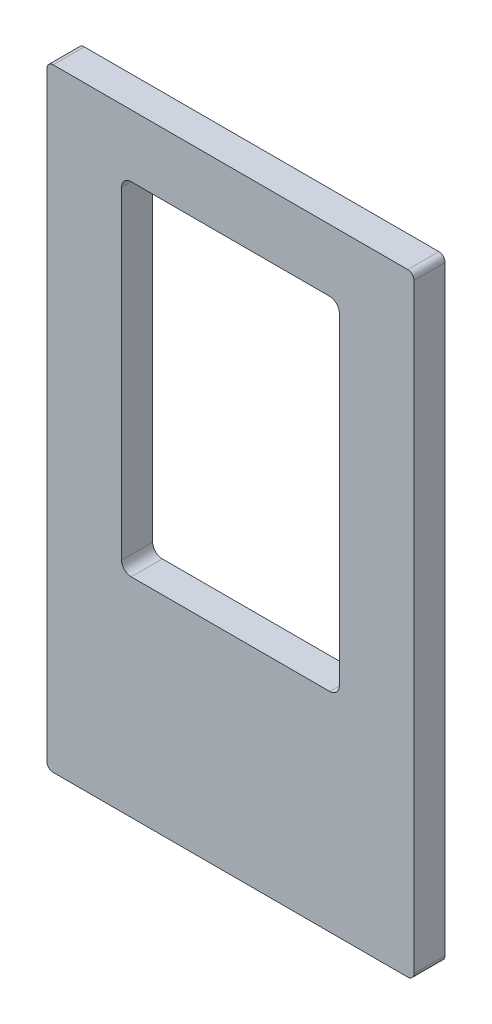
ISO-10303-21;
HEADER;
FILE_DESCRIPTION(('STEP AP214'),'2;1');
FILE_NAME('part.step','',(''),(''),'','','');
FILE_SCHEMA(('AUTOMOTIVE_DESIGN { 1 0 10303 214 1 1 1 1 }'));
ENDSEC;
DATA;
#1=APPLICATION_CONTEXT('core data for automotive mechanical design processes');
#2=APPLICATION_PROTOCOL_DEFINITION('international standard','automotive_design',2000,#1);
#3=PRODUCT_CONTEXT('',#1,'mechanical');
#4=PRODUCT('Part','Part','',(#3));
#5=PRODUCT_RELATED_PRODUCT_CATEGORY('part','',(#4));
#6=PRODUCT_DEFINITION_FORMATION('','',#4);
#7=PRODUCT_DEFINITION_CONTEXT('part definition',#1,'design');
#8=PRODUCT_DEFINITION('design','',#6,#7);
#9=PRODUCT_DEFINITION_SHAPE('','',#8);
#10=(LENGTH_UNIT() NAMED_UNIT(*) SI_UNIT(.MILLI.,.METRE.));
#11=(NAMED_UNIT(*) PLANE_ANGLE_UNIT() SI_UNIT($,.RADIAN.));
#12=(NAMED_UNIT(*) SI_UNIT($,.STERADIAN.) SOLID_ANGLE_UNIT());
#13=UNCERTAINTY_MEASURE_WITH_UNIT(LENGTH_MEASURE(1.E-05),#10,'distance_accuracy_value','');
#14=(GEOMETRIC_REPRESENTATION_CONTEXT(3) GLOBAL_UNCERTAINTY_ASSIGNED_CONTEXT((#13)) GLOBAL_UNIT_ASSIGNED_CONTEXT((#10,
#11,#12)) REPRESENTATION_CONTEXT('',''));
#15=CARTESIAN_POINT('',(0.,0.,0.));
#16=DIRECTION('',(0.,0.,1.));
#17=DIRECTION('',(1.,0.,0.));
#18=AXIS2_PLACEMENT_3D('',#15,#16,#17);
#19=CARTESIAN_POINT('',(-71.5649659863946,144.905555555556,10.));
#20=DIRECTION('',(0.,0.,-1.));
#21=DIRECTION('',(-1.,0.,0.));
#22=AXIS2_PLACEMENT_3D('',#19,#20,#21);
#23=CYLINDRICAL_SURFACE('',#22,2.);
#24=CARTESIAN_POINT('',(-71.5649659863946,144.905555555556,0.));
#25=DIRECTION('',(0.,0.,1.));
#26=DIRECTION('',(1.,0.,0.));
#27=AXIS2_PLACEMENT_3D('',#24,#25,#26);
#28=CIRCLE('',#27,2.);
#29=CARTESIAN_POINT('',(-71.5649659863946,146.905555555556,0.));
#30=VERTEX_POINT('',#29);
#31=CARTESIAN_POINT('',(-73.5649659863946,144.905555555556,0.));
#32=VERTEX_POINT('',#31);
#33=EDGE_CURVE('E203',#30,#32,#28,.T.);
#34=ORIENTED_EDGE('',*,*,#33,.T.);
#35=DIRECTION('',(0.,0.,-1.));
#36=VECTOR('',#35,1.);
#37=CARTESIAN_POINT('',(-73.5649659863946,144.905555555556,10.));
#38=LINE('',#37,#36);
#39=CARTESIAN_POINT('',(-73.5649659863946,144.905555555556,10.));
#40=VERTEX_POINT('',#39);
#41=EDGE_CURVE('E11',#40,#32,#38,.T.);
#42=ORIENTED_EDGE('',*,*,#41,.F.);
#43=CARTESIAN_POINT('',(-71.5649659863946,144.905555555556,10.));
#44=DIRECTION('',(0.,0.,1.));
#45=DIRECTION('',(1.,0.,0.));
#46=AXIS2_PLACEMENT_3D('',#43,#44,#45);
#47=CIRCLE('',#46,2.);
#48=CARTESIAN_POINT('',(-71.5649659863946,146.905555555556,10.));
#49=VERTEX_POINT('',#48);
#50=EDGE_CURVE('E215',#49,#40,#47,.T.);
#51=ORIENTED_EDGE('',*,*,#50,.F.);
#52=DIRECTION('',(0.,0.,-1.));
#53=VECTOR('',#52,1.);
#54=CARTESIAN_POINT('',(-71.5649659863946,146.905555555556,10.));
#55=LINE('',#54,#53);
#56=EDGE_CURVE('E233',#49,#30,#55,.T.);
#57=ORIENTED_EDGE('',*,*,#56,.T.);
#58=EDGE_LOOP('',(#34,#42,#51,#57));
#59=FACE_BOUND('',#58,.T.);
#60=ADVANCED_FACE('F34',(#59),#23,.T.);
#61=CARTESIAN_POINT('',(-73.5649659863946,144.905555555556,10.));
#62=DIRECTION('',(1.,0.,0.));
#63=DIRECTION('',(0.,1.,0.));
#64=AXIS2_PLACEMENT_3D('',#61,#62,#63);
#65=PLANE('',#64);
#66=DIRECTION('',(0.,-1.,0.));
#67=VECTOR('',#66,1.);
#68=CARTESIAN_POINT('',(-73.5649659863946,144.905555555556,0.));
#69=LINE('',#68,#67);
#70=CARTESIAN_POINT('',(-73.5649659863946,-48.0944444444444,0.));
#71=VERTEX_POINT('',#70);
#72=EDGE_CURVE('E236',#32,#71,#69,.T.);
#73=ORIENTED_EDGE('',*,*,#72,.T.);
#74=DIRECTION('',(0.,0.,-1.));
#75=VECTOR('',#74,1.);
#76=CARTESIAN_POINT('',(-73.5649659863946,-48.0944444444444,10.));
#77=LINE('',#76,#75);
#78=CARTESIAN_POINT('',(-73.5649659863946,-48.0944444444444,10.));
#79=VERTEX_POINT('',#78);
#80=EDGE_CURVE('E41',#79,#71,#77,.T.);
#81=ORIENTED_EDGE('',*,*,#80,.F.);
#82=DIRECTION('',(0.,-1.,0.));
#83=VECTOR('',#82,1.);
#84=CARTESIAN_POINT('',(-73.5649659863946,144.905555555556,10.));
#85=LINE('',#84,#83);
#86=EDGE_CURVE('E218',#40,#79,#85,.T.);
#87=ORIENTED_EDGE('',*,*,#86,.F.);
#88=ORIENTED_EDGE('',*,*,#41,.T.);
#89=EDGE_LOOP('',(#73,#81,#87,#88));
#90=FACE_BOUND('',#89,.T.);
#91=ADVANCED_FACE('F291',(#90),#65,.F.);
#92=CARTESIAN_POINT('',(-71.5649659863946,-48.0944444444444,10.));
#93=DIRECTION('',(0.,0.,-1.));
#94=DIRECTION('',(-1.,0.,0.));
#95=AXIS2_PLACEMENT_3D('',#92,#93,#94);
#96=CYLINDRICAL_SURFACE('',#95,2.);
#97=CARTESIAN_POINT('',(-71.5649659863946,-48.0944444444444,0.));
#98=DIRECTION('',(0.,0.,1.));
#99=DIRECTION('',(1.,0.,0.));
#100=AXIS2_PLACEMENT_3D('',#97,#98,#99);
#101=CIRCLE('',#100,2.);
#102=CARTESIAN_POINT('',(-71.5649659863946,-50.0944444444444,0.));
#103=VERTEX_POINT('',#102);
#104=EDGE_CURVE('E238',#71,#103,#101,.T.);
#105=ORIENTED_EDGE('',*,*,#104,.T.);
#106=DIRECTION('',(0.,0.,-1.));
#107=VECTOR('',#106,1.);
#108=CARTESIAN_POINT('',(-71.5649659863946,-50.0944444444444,10.));
#109=LINE('',#108,#107);
#110=CARTESIAN_POINT('',(-71.5649659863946,-50.0944444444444,10.));
#111=VERTEX_POINT('',#110);
#112=EDGE_CURVE('E263',#111,#103,#109,.T.);
#113=ORIENTED_EDGE('',*,*,#112,.F.);
#114=CARTESIAN_POINT('',(-71.5649659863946,-48.0944444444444,10.));
#115=DIRECTION('',(0.,0.,1.));
#116=DIRECTION('',(1.,0.,0.));
#117=AXIS2_PLACEMENT_3D('',#114,#115,#116);
#118=CIRCLE('',#117,2.);
#119=EDGE_CURVE('E221',#79,#111,#118,.T.);
#120=ORIENTED_EDGE('',*,*,#119,.F.);
#121=ORIENTED_EDGE('',*,*,#80,.T.);
#122=EDGE_LOOP('',(#105,#113,#120,#121));
#123=FACE_BOUND('',#122,.T.);
#124=ADVANCED_FACE('F270',(#123),#96,.T.);
#125=CARTESIAN_POINT('',(-71.5649659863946,-50.0944444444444,10.));
#126=DIRECTION('',(0.,1.,0.));
#127=DIRECTION('',(0.,0.,1.));
#128=AXIS2_PLACEMENT_3D('',#125,#126,#127);
#129=PLANE('',#128);
#130=DIRECTION('',(1.,0.,0.));
#131=VECTOR('',#130,1.);
#132=CARTESIAN_POINT('',(-71.5649659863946,-50.0944444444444,0.));
#133=LINE('',#132,#131);
#134=CARTESIAN_POINT('',(42.4350340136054,-50.0944444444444,0.));
#135=VERTEX_POINT('',#134);
#136=EDGE_CURVE('E240',#103,#135,#133,.T.);
#137=ORIENTED_EDGE('',*,*,#136,.T.);
#138=DIRECTION('',(0.,0.,-1.));
#139=VECTOR('',#138,1.);
#140=CARTESIAN_POINT('',(42.4350340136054,-50.0944444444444,10.));
#141=LINE('',#140,#139);
#142=CARTESIAN_POINT('',(42.4350340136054,-50.0944444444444,10.));
#143=VERTEX_POINT('',#142);
#144=EDGE_CURVE('E260',#143,#135,#141,.T.);
#145=ORIENTED_EDGE('',*,*,#144,.F.);
#146=DIRECTION('',(1.,0.,0.));
#147=VECTOR('',#146,1.);
#148=CARTESIAN_POINT('',(-71.5649659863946,-50.0944444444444,10.));
#149=LINE('',#148,#147);
#150=EDGE_CURVE('E223',#111,#143,#149,.T.);
#151=ORIENTED_EDGE('',*,*,#150,.F.);
#152=ORIENTED_EDGE('',*,*,#112,.T.);
#153=EDGE_LOOP('',(#137,#145,#151,#152));
#154=FACE_BOUND('',#153,.T.);
#155=ADVANCED_FACE('F281',(#154),#129,.F.);
#156=CARTESIAN_POINT('',(42.4350340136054,-48.0944444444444,10.));
#157=DIRECTION('',(0.,0.,-1.));
#158=DIRECTION('',(-1.,0.,0.));
#159=AXIS2_PLACEMENT_3D('',#156,#157,#158);
#160=CYLINDRICAL_SURFACE('',#159,1.99999999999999);
#161=CARTESIAN_POINT('',(42.4350340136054,-48.0944444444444,0.));
#162=DIRECTION('',(0.,0.,1.));
#163=DIRECTION('',(1.,0.,0.));
#164=AXIS2_PLACEMENT_3D('',#161,#162,#163);
#165=CIRCLE('',#164,1.99999999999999);
#166=CARTESIAN_POINT('',(44.4350340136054,-48.0944444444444,0.));
#167=VERTEX_POINT('',#166);
#168=EDGE_CURVE('E242',#135,#167,#165,.T.);
#169=ORIENTED_EDGE('',*,*,#168,.T.);
#170=DIRECTION('',(0.,0.,-1.));
#171=VECTOR('',#170,1.);
#172=CARTESIAN_POINT('',(44.4350340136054,-48.0944444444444,10.));
#173=LINE('',#172,#171);
#174=CARTESIAN_POINT('',(44.4350340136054,-48.0944444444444,10.));
#175=VERTEX_POINT('',#174);
#176=EDGE_CURVE('E257',#175,#167,#173,.T.);
#177=ORIENTED_EDGE('',*,*,#176,.F.);
#178=CARTESIAN_POINT('',(42.4350340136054,-48.0944444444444,10.));
#179=DIRECTION('',(0.,0.,1.));
#180=DIRECTION('',(1.,0.,0.));
#181=AXIS2_PLACEMENT_3D('',#178,#179,#180);
#182=CIRCLE('',#181,1.99999999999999);
#183=EDGE_CURVE('E225',#143,#175,#182,.T.);
#184=ORIENTED_EDGE('',*,*,#183,.F.);
#185=ORIENTED_EDGE('',*,*,#144,.T.);
#186=EDGE_LOOP('',(#169,#177,#184,#185));
#187=FACE_BOUND('',#186,.T.);
#188=ADVANCED_FACE('F285',(#187),#160,.T.);
#189=CARTESIAN_POINT('',(44.4350340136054,144.905555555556,10.));
#190=DIRECTION('',(-1.,0.,0.));
#191=DIRECTION('',(0.,-1.,0.));
#192=AXIS2_PLACEMENT_3D('',#189,#190,#191);
#193=PLANE('',#192);
#194=DIRECTION('',(0.,1.,0.));
#195=VECTOR('',#194,1.);
#196=CARTESIAN_POINT('',(44.4350340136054,144.905555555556,0.));
#197=LINE('',#196,#195);
#198=CARTESIAN_POINT('',(44.4350340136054,144.905555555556,0.));
#199=VERTEX_POINT('',#198);
#200=EDGE_CURVE('E244',#167,#199,#197,.T.);
#201=ORIENTED_EDGE('',*,*,#200,.T.);
#202=DIRECTION('',(0.,0.,-1.));
#203=VECTOR('',#202,1.);
#204=CARTESIAN_POINT('',(44.4350340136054,144.905555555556,10.));
#205=LINE('',#204,#203);
#206=CARTESIAN_POINT('',(44.4350340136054,144.905555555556,10.));
#207=VERTEX_POINT('',#206);
#208=EDGE_CURVE('E254',#207,#199,#205,.T.);
#209=ORIENTED_EDGE('',*,*,#208,.F.);
#210=DIRECTION('',(0.,1.,0.));
#211=VECTOR('',#210,1.);
#212=CARTESIAN_POINT('',(44.4350340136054,144.905555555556,10.));
#213=LINE('',#212,#211);
#214=EDGE_CURVE('E227',#175,#207,#213,.T.);
#215=ORIENTED_EDGE('',*,*,#214,.F.);
#216=ORIENTED_EDGE('',*,*,#176,.T.);
#217=EDGE_LOOP('',(#201,#209,#215,#216));
#218=FACE_BOUND('',#217,.T.);
#219=ADVANCED_FACE('F304',(#218),#193,.F.);
#220=CARTESIAN_POINT('',(42.4350340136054,144.905555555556,10.));
#221=DIRECTION('',(0.,0.,-1.));
#222=DIRECTION('',(-1.,0.,0.));
#223=AXIS2_PLACEMENT_3D('',#220,#221,#222);
#224=CYLINDRICAL_SURFACE('',#223,2.);
#225=CARTESIAN_POINT('',(42.4350340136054,144.905555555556,0.));
#226=DIRECTION('',(0.,0.,1.));
#227=DIRECTION('',(-1.,0.,0.));
#228=AXIS2_PLACEMENT_3D('',#225,#226,#227);
#229=CIRCLE('',#228,2.);
#230=CARTESIAN_POINT('',(42.4350340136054,146.905555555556,0.));
#231=VERTEX_POINT('',#230);
#232=EDGE_CURVE('E246',#199,#231,#229,.T.);
#233=ORIENTED_EDGE('',*,*,#232,.T.);
#234=DIRECTION('',(0.,0.,-1.));
#235=VECTOR('',#234,1.);
#236=CARTESIAN_POINT('',(42.4350340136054,146.905555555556,10.));
#237=LINE('',#236,#235);
#238=CARTESIAN_POINT('',(42.4350340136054,146.905555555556,10.));
#239=VERTEX_POINT('',#238);
#240=EDGE_CURVE('E251',#239,#231,#237,.T.);
#241=ORIENTED_EDGE('',*,*,#240,.F.);
#242=CARTESIAN_POINT('',(42.4350340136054,144.905555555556,10.));
#243=DIRECTION('',(0.,0.,1.));
#244=DIRECTION('',(-1.,0.,0.));
#245=AXIS2_PLACEMENT_3D('',#242,#243,#244);
#246=CIRCLE('',#245,2.);
#247=EDGE_CURVE('E229',#207,#239,#246,.T.);
#248=ORIENTED_EDGE('',*,*,#247,.F.);
#249=ORIENTED_EDGE('',*,*,#208,.T.);
#250=EDGE_LOOP('',(#233,#241,#248,#249));
#251=FACE_BOUND('',#250,.T.);
#252=ADVANCED_FACE('F302',(#251),#224,.T.);
#253=CARTESIAN_POINT('',(-71.5649659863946,146.905555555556,10.));
#254=DIRECTION('',(0.,-1.,0.));
#255=DIRECTION('',(0.,0.,-1.));
#256=AXIS2_PLACEMENT_3D('',#253,#254,#255);
#257=PLANE('',#256);
#258=DIRECTION('',(-1.,0.,0.));
#259=VECTOR('',#258,1.);
#260=CARTESIAN_POINT('',(-71.5649659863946,146.905555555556,0.));
#261=LINE('',#260,#259);
#262=EDGE_CURVE('E219',#231,#30,#261,.T.);
#263=ORIENTED_EDGE('',*,*,#262,.T.);
#264=ORIENTED_EDGE('',*,*,#56,.F.);
#265=DIRECTION('',(-1.,0.,0.));
#266=VECTOR('',#265,1.);
#267=CARTESIAN_POINT('',(-71.5649659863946,146.905555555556,10.));
#268=LINE('',#267,#266);
#269=EDGE_CURVE('E231',#239,#49,#268,.T.);
#270=ORIENTED_EDGE('',*,*,#269,.F.);
#271=ORIENTED_EDGE('',*,*,#240,.T.);
#272=EDGE_LOOP('',(#263,#264,#270,#271));
#273=FACE_BOUND('',#272,.T.);
#274=ADVANCED_FACE('F297',(#273),#257,.F.);
#275=CARTESIAN_POINT('',(-71.5649659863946,144.905555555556,10.));
#276=DIRECTION('',(0.,0.,1.));
#277=DIRECTION('',(1.,0.,0.));
#278=AXIS2_PLACEMENT_3D('',#275,#276,#277);
#279=PLANE('',#278);
#280=CARTESIAN_POINT('',(17.3350340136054,20.0055555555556,10.));
#281=DIRECTION('',(0.,0.,-1.));
#282=DIRECTION('',(-1.,0.,0.));
#283=AXIS2_PLACEMENT_3D('',#280,#281,#282);
#284=CIRCLE('',#283,3.1);
#285=CARTESIAN_POINT('',(20.4350340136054,20.0055555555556,10.));
#286=VERTEX_POINT('',#285);
#287=CARTESIAN_POINT('',(17.3350340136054,16.9055555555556,10.));
#288=VERTEX_POINT('',#287);
#289=EDGE_CURVE('E148',#286,#288,#284,.T.);
#290=ORIENTED_EDGE('',*,*,#289,.T.);
#291=DIRECTION('',(-1.,0.,0.));
#292=VECTOR('',#291,1.);
#293=CARTESIAN_POINT('',(17.3350340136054,16.9055555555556,10.));
#294=LINE('',#293,#292);
#295=CARTESIAN_POINT('',(-46.4649659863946,16.9055555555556,10.));
#296=VERTEX_POINT('',#295);
#297=EDGE_CURVE('E157',#288,#296,#294,.T.);
#298=ORIENTED_EDGE('',*,*,#297,.T.);
#299=CARTESIAN_POINT('',(-46.4649659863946,20.0055555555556,10.));
#300=DIRECTION('',(0.,0.,-1.));
#301=DIRECTION('',(-1.,0.,0.));
#302=AXIS2_PLACEMENT_3D('',#299,#300,#301);
#303=CIRCLE('',#302,3.1);
#304=CARTESIAN_POINT('',(-49.5649659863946,20.0055555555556,10.));
#305=VERTEX_POINT('',#304);
#306=EDGE_CURVE('E48',#296,#305,#303,.T.);
#307=ORIENTED_EDGE('',*,*,#306,.T.);
#308=DIRECTION('',(0.,1.,0.));
#309=VECTOR('',#308,1.);
#310=CARTESIAN_POINT('',(-49.5649659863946,123.805555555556,10.));
#311=LINE('',#310,#309);
#312=CARTESIAN_POINT('',(-49.5649659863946,123.805555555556,10.));
#313=VERTEX_POINT('',#312);
#314=EDGE_CURVE('E172',#305,#313,#311,.T.);
#315=ORIENTED_EDGE('',*,*,#314,.T.);
#316=CARTESIAN_POINT('',(-46.4649659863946,123.805555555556,10.));
#317=DIRECTION('',(0.,0.,-1.));
#318=DIRECTION('',(1.,0.,0.));
#319=AXIS2_PLACEMENT_3D('',#316,#317,#318);
#320=CIRCLE('',#319,3.1);
#321=CARTESIAN_POINT('',(-46.4649659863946,126.905555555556,10.));
#322=VERTEX_POINT('',#321);
#323=EDGE_CURVE('E175',#313,#322,#320,.T.);
#324=ORIENTED_EDGE('',*,*,#323,.T.);
#325=DIRECTION('',(1.,0.,0.));
#326=VECTOR('',#325,1.);
#327=CARTESIAN_POINT('',(17.3350340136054,126.905555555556,10.));
#328=LINE('',#327,#326);
#329=CARTESIAN_POINT('',(17.3350340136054,126.905555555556,10.));
#330=VERTEX_POINT('',#329);
#331=EDGE_CURVE('E178',#322,#330,#328,.T.);
#332=ORIENTED_EDGE('',*,*,#331,.T.);
#333=CARTESIAN_POINT('',(17.3350340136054,123.805555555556,10.));
#334=DIRECTION('',(0.,0.,-1.));
#335=DIRECTION('',(-1.,0.,0.));
#336=AXIS2_PLACEMENT_3D('',#333,#334,#335);
#337=CIRCLE('',#336,3.1);
#338=CARTESIAN_POINT('',(20.4350340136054,123.805555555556,10.));
#339=VERTEX_POINT('',#338);
#340=EDGE_CURVE('E181',#330,#339,#337,.T.);
#341=ORIENTED_EDGE('',*,*,#340,.T.);
#342=DIRECTION('',(0.,-1.,0.));
#343=VECTOR('',#342,1.);
#344=CARTESIAN_POINT('',(20.4350340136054,123.805555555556,10.));
#345=LINE('',#344,#343);
#346=EDGE_CURVE('E154',#339,#286,#345,.T.);
#347=ORIENTED_EDGE('',*,*,#346,.T.);
#348=EDGE_LOOP('',(#290,#298,#307,#315,#324,#332,#341,#347));
#349=FACE_BOUND('',#348,.T.);
#350=ORIENTED_EDGE('',*,*,#50,.T.);
#351=ORIENTED_EDGE('',*,*,#86,.T.);
#352=ORIENTED_EDGE('',*,*,#119,.T.);
#353=ORIENTED_EDGE('',*,*,#150,.T.);
#354=ORIENTED_EDGE('',*,*,#183,.T.);
#355=ORIENTED_EDGE('',*,*,#214,.T.);
#356=ORIENTED_EDGE('',*,*,#247,.T.);
#357=ORIENTED_EDGE('',*,*,#269,.T.);
#358=EDGE_LOOP('',(#350,#351,#352,#353,#354,#355,#356,#357));
#359=FACE_BOUND('',#358,.T.);
#360=ADVANCED_FACE('F161',(#349,#359),#279,.T.);
#361=CARTESIAN_POINT('',(-71.5649659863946,144.905555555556,0.));
#362=DIRECTION('',(0.,0.,1.));
#363=DIRECTION('',(1.,0.,0.));
#364=AXIS2_PLACEMENT_3D('',#361,#362,#363);
#365=PLANE('',#364);
#366=DIRECTION('',(-1.,0.,0.));
#367=VECTOR('',#366,1.);
#368=CARTESIAN_POINT('',(17.3350340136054,16.9055555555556,0.));
#369=LINE('',#368,#367);
#370=CARTESIAN_POINT('',(17.3350340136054,16.9055555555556,0.));
#371=VERTEX_POINT('',#370);
#372=CARTESIAN_POINT('',(-46.4649659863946,16.9055555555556,0.));
#373=VERTEX_POINT('',#372);
#374=EDGE_CURVE('E185',#371,#373,#369,.T.);
#375=ORIENTED_EDGE('',*,*,#374,.F.);
#376=CARTESIAN_POINT('',(17.3350340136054,20.0055555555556,0.));
#377=DIRECTION('',(0.,0.,-1.));
#378=DIRECTION('',(-1.,0.,0.));
#379=AXIS2_PLACEMENT_3D('',#376,#377,#378);
#380=CIRCLE('',#379,3.1);
#381=CARTESIAN_POINT('',(20.4350340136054,20.0055555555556,0.));
#382=VERTEX_POINT('',#381);
#383=EDGE_CURVE('E56',#382,#371,#380,.T.);
#384=ORIENTED_EDGE('',*,*,#383,.F.);
#385=DIRECTION('',(0.,-1.,0.));
#386=VECTOR('',#385,1.);
#387=CARTESIAN_POINT('',(20.4350340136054,123.805555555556,0.));
#388=LINE('',#387,#386);
#389=CARTESIAN_POINT('',(20.4350340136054,123.805555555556,0.));
#390=VERTEX_POINT('',#389);
#391=EDGE_CURVE('E165',#390,#382,#388,.T.);
#392=ORIENTED_EDGE('',*,*,#391,.F.);
#393=CARTESIAN_POINT('',(17.3350340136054,123.805555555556,0.));
#394=DIRECTION('',(0.,0.,-1.));
#395=DIRECTION('',(-1.,0.,0.));
#396=AXIS2_PLACEMENT_3D('',#393,#394,#395);
#397=CIRCLE('',#396,3.1);
#398=CARTESIAN_POINT('',(17.3350340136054,126.905555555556,0.));
#399=VERTEX_POINT('',#398);
#400=EDGE_CURVE('E168',#399,#390,#397,.T.);
#401=ORIENTED_EDGE('',*,*,#400,.F.);
#402=DIRECTION('',(1.,0.,0.));
#403=VECTOR('',#402,1.);
#404=CARTESIAN_POINT('',(17.3350340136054,126.905555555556,0.));
#405=LINE('',#404,#403);
#406=CARTESIAN_POINT('',(-46.4649659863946,126.905555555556,0.));
#407=VERTEX_POINT('',#406);
#408=EDGE_CURVE('E196',#407,#399,#405,.T.);
#409=ORIENTED_EDGE('',*,*,#408,.F.);
#410=CARTESIAN_POINT('',(-46.4649659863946,123.805555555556,0.));
#411=DIRECTION('',(0.,0.,-1.));
#412=DIRECTION('',(1.,0.,0.));
#413=AXIS2_PLACEMENT_3D('',#410,#411,#412);
#414=CIRCLE('',#413,3.1);
#415=CARTESIAN_POINT('',(-49.5649659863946,123.805555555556,0.));
#416=VERTEX_POINT('',#415);
#417=EDGE_CURVE('E193',#416,#407,#414,.T.);
#418=ORIENTED_EDGE('',*,*,#417,.F.);
#419=DIRECTION('',(0.,1.,0.));
#420=VECTOR('',#419,1.);
#421=CARTESIAN_POINT('',(-49.5649659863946,123.805555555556,0.));
#422=LINE('',#421,#420);
#423=CARTESIAN_POINT('',(-49.5649659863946,20.0055555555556,0.));
#424=VERTEX_POINT('',#423);
#425=EDGE_CURVE('E190',#424,#416,#422,.T.);
#426=ORIENTED_EDGE('',*,*,#425,.F.);
#427=CARTESIAN_POINT('',(-46.4649659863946,20.0055555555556,0.));
#428=DIRECTION('',(0.,0.,-1.));
#429=DIRECTION('',(-1.,0.,0.));
#430=AXIS2_PLACEMENT_3D('',#427,#428,#429);
#431=CIRCLE('',#430,3.1);
#432=EDGE_CURVE('E187',#373,#424,#431,.T.);
#433=ORIENTED_EDGE('',*,*,#432,.F.);
#434=EDGE_LOOP('',(#375,#384,#392,#401,#409,#418,#426,#433));
#435=FACE_BOUND('',#434,.T.);
#436=ORIENTED_EDGE('',*,*,#33,.F.);
#437=ORIENTED_EDGE('',*,*,#262,.F.);
#438=ORIENTED_EDGE('',*,*,#232,.F.);
#439=ORIENTED_EDGE('',*,*,#200,.F.);
#440=ORIENTED_EDGE('',*,*,#168,.F.);
#441=ORIENTED_EDGE('',*,*,#136,.F.);
#442=ORIENTED_EDGE('',*,*,#104,.F.);
#443=ORIENTED_EDGE('',*,*,#72,.F.);
#444=EDGE_LOOP('',(#436,#437,#438,#439,#440,#441,#442,#443));
#445=FACE_BOUND('',#444,.T.);
#446=ADVANCED_FACE('F276',(#435,#445),#365,.F.);
#447=CARTESIAN_POINT('',(17.3350340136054,20.0055555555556,10.));
#448=DIRECTION('',(0.,0.,-1.));
#449=DIRECTION('',(-1.,0.,0.));
#450=AXIS2_PLACEMENT_3D('',#447,#448,#449);
#451=CYLINDRICAL_SURFACE('',#450,3.1);
#452=ORIENTED_EDGE('',*,*,#383,.T.);
#453=DIRECTION('',(0.,0.,-1.));
#454=VECTOR('',#453,1.);
#455=CARTESIAN_POINT('',(17.3350340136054,16.9055555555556,10.));
#456=LINE('',#455,#454);
#457=EDGE_CURVE('E144',#288,#371,#456,.T.);
#458=ORIENTED_EDGE('',*,*,#457,.F.);
#459=ORIENTED_EDGE('',*,*,#289,.F.);
#460=DIRECTION('',(0.,0.,-1.));
#461=VECTOR('',#460,1.);
#462=CARTESIAN_POINT('',(20.4350340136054,20.0055555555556,10.));
#463=LINE('',#462,#461);
#464=EDGE_CURVE('E201',#286,#382,#463,.T.);
#465=ORIENTED_EDGE('',*,*,#464,.T.);
#466=EDGE_LOOP('',(#452,#458,#459,#465));
#467=FACE_BOUND('',#466,.T.);
#468=ADVANCED_FACE('F146',(#467),#451,.F.);
#469=CARTESIAN_POINT('',(20.4350340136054,123.805555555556,10.));
#470=DIRECTION('',(1.,0.,0.));
#471=DIRECTION('',(0.,1.,0.));
#472=AXIS2_PLACEMENT_3D('',#469,#470,#471);
#473=PLANE('',#472);
#474=ORIENTED_EDGE('',*,*,#391,.T.);
#475=ORIENTED_EDGE('',*,*,#464,.F.);
#476=ORIENTED_EDGE('',*,*,#346,.F.);
#477=DIRECTION('',(0.,0.,-1.));
#478=VECTOR('',#477,1.);
#479=CARTESIAN_POINT('',(20.4350340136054,123.805555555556,10.));
#480=LINE('',#479,#478);
#481=EDGE_CURVE('E204',#339,#390,#480,.T.);
#482=ORIENTED_EDGE('',*,*,#481,.T.);
#483=EDGE_LOOP('',(#474,#475,#476,#482));
#484=FACE_BOUND('',#483,.T.);
#485=ADVANCED_FACE('F375',(#484),#473,.F.);
#486=CARTESIAN_POINT('',(17.3350340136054,123.805555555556,10.));
#487=DIRECTION('',(0.,0.,-1.));
#488=DIRECTION('',(-1.,0.,0.));
#489=AXIS2_PLACEMENT_3D('',#486,#487,#488);
#490=CYLINDRICAL_SURFACE('',#489,3.1);
#491=ORIENTED_EDGE('',*,*,#400,.T.);
#492=ORIENTED_EDGE('',*,*,#481,.F.);
#493=ORIENTED_EDGE('',*,*,#340,.F.);
#494=DIRECTION('',(0.,0.,-1.));
#495=VECTOR('',#494,1.);
#496=CARTESIAN_POINT('',(17.3350340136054,126.905555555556,10.));
#497=LINE('',#496,#495);
#498=EDGE_CURVE('E206',#330,#399,#497,.T.);
#499=ORIENTED_EDGE('',*,*,#498,.T.);
#500=EDGE_LOOP('',(#491,#492,#493,#499));
#501=FACE_BOUND('',#500,.T.);
#502=ADVANCED_FACE('F384',(#501),#490,.F.);
#503=CARTESIAN_POINT('',(17.3350340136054,126.905555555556,10.));
#504=DIRECTION('',(0.,1.,0.));
#505=DIRECTION('',(0.,0.,1.));
#506=AXIS2_PLACEMENT_3D('',#503,#504,#505);
#507=PLANE('',#506);
#508=ORIENTED_EDGE('',*,*,#408,.T.);
#509=ORIENTED_EDGE('',*,*,#498,.F.);
#510=ORIENTED_EDGE('',*,*,#331,.F.);
#511=DIRECTION('',(0.,0.,-1.));
#512=VECTOR('',#511,1.);
#513=CARTESIAN_POINT('',(-46.4649659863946,126.905555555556,10.));
#514=LINE('',#513,#512);
#515=EDGE_CURVE('E208',#322,#407,#514,.T.);
#516=ORIENTED_EDGE('',*,*,#515,.T.);
#517=EDGE_LOOP('',(#508,#509,#510,#516));
#518=FACE_BOUND('',#517,.T.);
#519=ADVANCED_FACE('F394',(#518),#507,.F.);
#520=CARTESIAN_POINT('',(-46.4649659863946,123.805555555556,10.));
#521=DIRECTION('',(0.,0.,-1.));
#522=DIRECTION('',(-1.,0.,0.));
#523=AXIS2_PLACEMENT_3D('',#520,#521,#522);
#524=CYLINDRICAL_SURFACE('',#523,3.1);
#525=ORIENTED_EDGE('',*,*,#417,.T.);
#526=ORIENTED_EDGE('',*,*,#515,.F.);
#527=ORIENTED_EDGE('',*,*,#323,.F.);
#528=DIRECTION('',(0.,0.,-1.));
#529=VECTOR('',#528,1.);
#530=CARTESIAN_POINT('',(-49.5649659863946,123.805555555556,10.));
#531=LINE('',#530,#529);
#532=EDGE_CURVE('E210',#313,#416,#531,.T.);
#533=ORIENTED_EDGE('',*,*,#532,.T.);
#534=EDGE_LOOP('',(#525,#526,#527,#533));
#535=FACE_BOUND('',#534,.T.);
#536=ADVANCED_FACE('F404',(#535),#524,.F.);
#537=CARTESIAN_POINT('',(-49.5649659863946,123.805555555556,10.));
#538=DIRECTION('',(-1.,0.,0.));
#539=DIRECTION('',(0.,-1.,0.));
#540=AXIS2_PLACEMENT_3D('',#537,#538,#539);
#541=PLANE('',#540);
#542=ORIENTED_EDGE('',*,*,#425,.T.);
#543=ORIENTED_EDGE('',*,*,#532,.F.);
#544=ORIENTED_EDGE('',*,*,#314,.F.);
#545=DIRECTION('',(0.,0.,-1.));
#546=VECTOR('',#545,1.);
#547=CARTESIAN_POINT('',(-49.5649659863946,20.0055555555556,10.));
#548=LINE('',#547,#546);
#549=EDGE_CURVE('E212',#305,#424,#548,.T.);
#550=ORIENTED_EDGE('',*,*,#549,.T.);
#551=EDGE_LOOP('',(#542,#543,#544,#550));
#552=FACE_BOUND('',#551,.T.);
#553=ADVANCED_FACE('F414',(#552),#541,.F.);
#554=CARTESIAN_POINT('',(-46.4649659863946,20.0055555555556,10.));
#555=DIRECTION('',(0.,0.,-1.));
#556=DIRECTION('',(-1.,0.,0.));
#557=AXIS2_PLACEMENT_3D('',#554,#555,#556);
#558=CYLINDRICAL_SURFACE('',#557,3.1);
#559=ORIENTED_EDGE('',*,*,#432,.T.);
#560=ORIENTED_EDGE('',*,*,#549,.F.);
#561=ORIENTED_EDGE('',*,*,#306,.F.);
#562=DIRECTION('',(0.,0.,-1.));
#563=VECTOR('',#562,1.);
#564=CARTESIAN_POINT('',(-46.4649659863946,16.9055555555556,10.));
#565=LINE('',#564,#563);
#566=EDGE_CURVE('E153',#296,#373,#565,.T.);
#567=ORIENTED_EDGE('',*,*,#566,.T.);
#568=EDGE_LOOP('',(#559,#560,#561,#567));
#569=FACE_BOUND('',#568,.T.);
#570=ADVANCED_FACE('F424',(#569),#558,.F.);
#571=CARTESIAN_POINT('',(17.3350340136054,16.9055555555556,10.));
#572=DIRECTION('',(0.,-1.,0.));
#573=DIRECTION('',(0.,0.,-1.));
#574=AXIS2_PLACEMENT_3D('',#571,#572,#573);
#575=PLANE('',#574);
#576=ORIENTED_EDGE('',*,*,#374,.T.);
#577=ORIENTED_EDGE('',*,*,#566,.F.);
#578=ORIENTED_EDGE('',*,*,#297,.F.);
#579=ORIENTED_EDGE('',*,*,#457,.T.);
#580=EDGE_LOOP('',(#576,#577,#578,#579));
#581=FACE_BOUND('',#580,.T.);
#582=ADVANCED_FACE('F158',(#581),#575,.F.);
#583=CLOSED_SHELL('',(#60,#91,#124,#155,#188,#219,#252,#274,#360,#446,#468,#485,#502,#519,#536,
#553,#570,#582));
#584=MANIFOLD_SOLID_BREP('B2',#583);
#585=ADVANCED_BREP_SHAPE_REPRESENTATION('',(#18,#584),#14);
#586=SHAPE_DEFINITION_REPRESENTATION(#9,#585);
ENDSEC;
END-ISO-10303-21;
